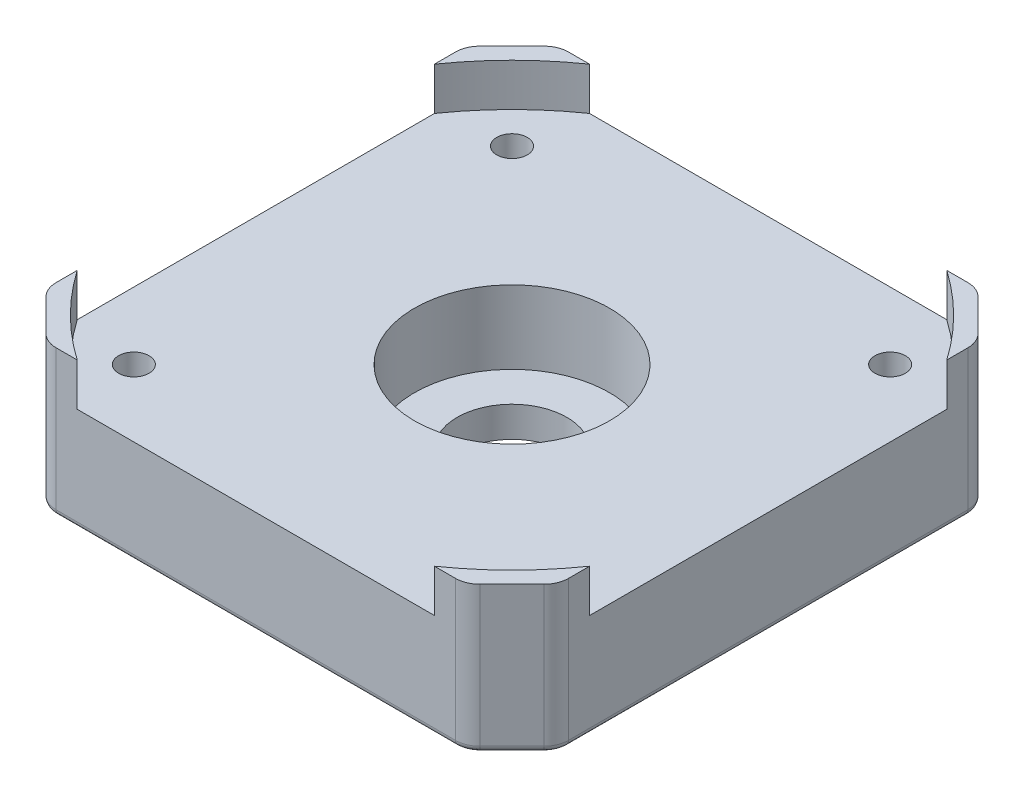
from build123d import *

# Parameters (mm, degrees)
SKETCH_1_R          = 4.5
SKETCH_1_R_2        = 1.25
EXTRUDE_1_DEPTH     = 8.5
EXTRUDE_2_DEPTH     = 12
CHAMFER_1_SIZE      = 2.5
SKETCH_2_R          = 8
CUT_EXTRUDE_1_DEPTH = 6
FILLET_1_R          = 2
FILLET_2_R          = 0.5


with BuildPart() as part:
    # Sketch 1 → Extrude 1 (new body)
    with BuildSketch(Plane(origin=(0, 0, 0), x_dir=(1, 0, 0), z_dir=(0, 1, 0))):
        with BuildLine():
            ThreePointArc((-14.641038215, 21), (-18.101933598, 18.101933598), (-21, 14.641038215))
            Line((-21, 14.641038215), (-21, -14.641038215))
            ThreePointArc((-21, -14.641038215), (-18.101933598, -18.101933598), (-14.641038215, -21))
            Line((-14.641038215, -21), (14.641038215, -21))
            ThreePointArc((14.641038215, -21), (18.101933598, -18.101933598), (21, -14.641038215))
            Line((21, -14.641038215), (21, 14.641038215))
            ThreePointArc((21, 14.641038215), (18.101933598, 18.101933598), (14.641038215, 21))
            Line((14.641038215, 21), (-14.641038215, 21))
        make_face()
        with Locations(Location((0, 0, 0), (0, 0, 270))):
            Circle(SKETCH_1_R, mode=Mode.SUBTRACT)
        with Locations(Location((-15.5, 15.5, 0), (0, 0, 270))):
            Circle(SKETCH_1_R_2, mode=Mode.SUBTRACT)
        with Locations(Location((15.5, 15.5, 0), (0, 0, 270))):
            Circle(SKETCH_1_R_2, mode=Mode.SUBTRACT)
        with Locations(Location((15.5, -15.5, 0), (0, 0, 270))):
            Circle(SKETCH_1_R_2, mode=Mode.SUBTRACT)
        with Locations(Location((-15.5, -15.5, 0), (0, 0, 270))):
            Circle(SKETCH_1_R_2, mode=Mode.SUBTRACT)
    extrude(amount=EXTRUDE_1_DEPTH)

    # Sketch 1_4 → Extrude 2 (add)
    with BuildSketch(Plane(origin=(0, 0, 0), x_dir=(1, 0, 0), z_dir=(0, 1, 0))):
        with BuildLine():
            ThreePointArc((21, -14.641038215), (18.101933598, -18.101933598), (14.641038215, -21))
            Line((14.641038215, -21), (17.2, -21))
            Line((17.2, -21), (21, -17.2))
            Line((21, -17.2), (21, -14.641038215))
        make_face()
        with BuildLine():
            ThreePointArc((-14.641038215, -21), (-18.101933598, -18.101933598), (-21, -14.641038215))
            Line((-21, -14.641038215), (-21, -17.2))
            Line((-21, -17.2), (-17.2, -21))
            Line((-17.2, -21), (-14.641038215, -21))
        make_face()
        with BuildLine():
            Line((-17.2, 21), (-21, 17.2))
            Line((-21, 17.2), (-21, 14.641038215))
            ThreePointArc((-21, 14.641038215), (-18.101933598, 18.101933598), (-14.641038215, 21))
            Line((-14.641038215, 21), (-17.2, 21))
        make_face()
        with BuildLine():
            Line((17.2, 21), (14.641038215, 21))
            ThreePointArc((14.641038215, 21), (18.101933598, 18.101933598), (21, 14.641038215))
            Line((21, 14.641038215), (21, 17.2))
            Line((21, 17.2), (17.2, 21))
        make_face()
    extrude(amount=EXTRUDE_2_DEPTH)

    # Chamfer 1
    chamfer_1_edges = [part.edges().sort_by_distance(p)[0] for p in [
        (-15.5, 0, 14.25),
        (15.5, 0, 14.25),
        (15.5, 0, -16.75),
        (-15.5, 0, -16.75),
    ]]
    chamfer(chamfer_1_edges, length=CHAMFER_1_SIZE)

    # Sketch 2 → Cut-Extrude 1 (cut)
    with BuildSketch(Plane(origin=(0, 8.5, 0), x_dir=(1, 0, 0), z_dir=(0, 1, 0))):
        with Locations(Location((0, 0, 0), (0, 0, 270))):
            Circle(SKETCH_2_R)
    extrude(amount=-CUT_EXTRUDE_1_DEPTH, mode=Mode.SUBTRACT)

    # Fillet 1
    fillet_1_edges = [part.edges().sort_by_distance(p)[0] for p in [
        (17.2, 6, 21),
        (21, 6, 17.2),
        (-21, 6, 17.2),
        (-17.2, 6, 21),
        (-17.2, 6, -21),
        (-21, 6, -17.2),
        (21, 6, -17.2),
        (17.2, 6, -21),
    ]]
    fillet(fillet_1_edges, radius=FILLET_1_R)

    # Fillet 2
    fillet_2_edges = [part.edges().sort_by_distance(p)[0] for p in [
        (21, 0, 0),
        (0, 0, 21),
        (-19.1, 0, 19.1),
        (-21, 0, 0),
        (-19.1, 0, -19.1),
        (0, 0, -21),
        (19.1, 0, -19.1),
        (19.1, 0, 19.1),
        (20.847759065, 0, -17.13693974),
        (17.13693974, 0, -20.847759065),
        (-17.13693974, 0, -20.847759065),
        (-20.847759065, 0, -17.13693974),
        (-20.847759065, 0, 17.13693974),
        (-17.13693974, 0, 20.847759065),
        (17.13693974, 0, 20.847759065),
        (20.847759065, 0, 17.13693974),
    ]]
    fillet(fillet_2_edges, radius=FILLET_2_R)


solid = part.part
